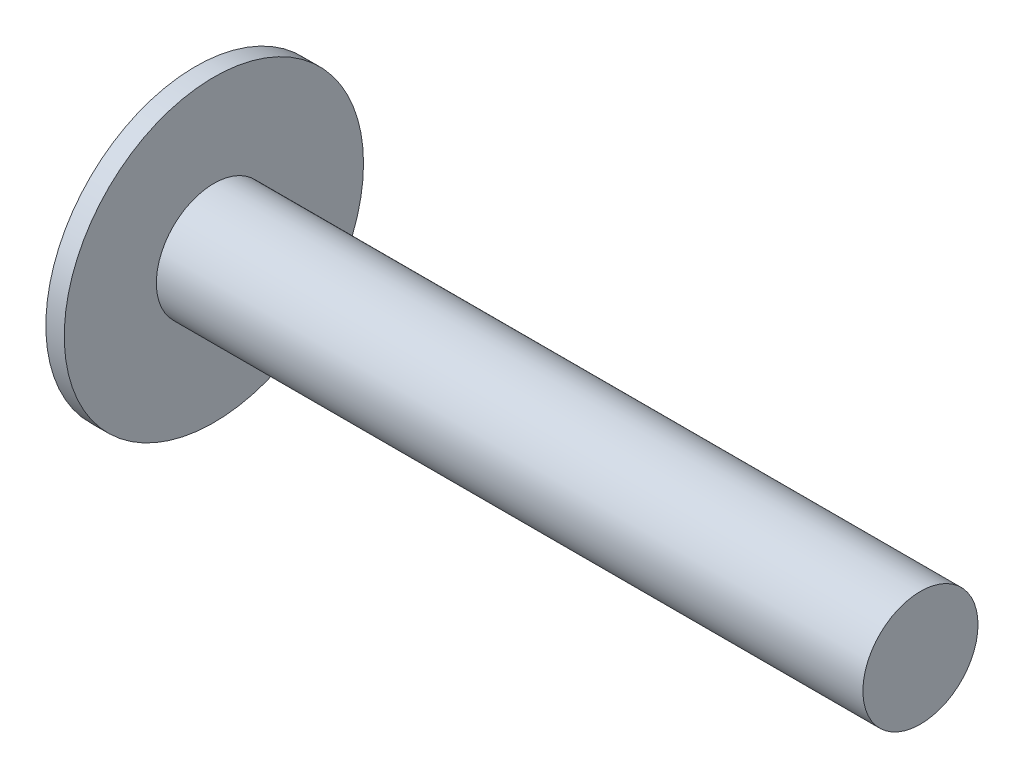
ISO-10303-21;
HEADER;
FILE_DESCRIPTION(('STEP AP214'),'2;1');
FILE_NAME('part.step','',(''),(''),'','','');
FILE_SCHEMA(('AUTOMOTIVE_DESIGN { 1 0 10303 214 1 1 1 1 }'));
ENDSEC;
DATA;
#1=APPLICATION_CONTEXT('core data for automotive mechanical design processes');
#2=APPLICATION_PROTOCOL_DEFINITION('international standard','automotive_design',2000,#1);
#3=PRODUCT_CONTEXT('',#1,'mechanical');
#4=PRODUCT('Part','Part','',(#3));
#5=PRODUCT_RELATED_PRODUCT_CATEGORY('part','',(#4));
#6=PRODUCT_DEFINITION_FORMATION('','',#4);
#7=PRODUCT_DEFINITION_CONTEXT('part definition',#1,'design');
#8=PRODUCT_DEFINITION('design','',#6,#7);
#9=PRODUCT_DEFINITION_SHAPE('','',#8);
#10=(LENGTH_UNIT() NAMED_UNIT(*) SI_UNIT(.MILLI.,.METRE.));
#11=(NAMED_UNIT(*) PLANE_ANGLE_UNIT() SI_UNIT($,.RADIAN.));
#12=(NAMED_UNIT(*) SI_UNIT($,.STERADIAN.) SOLID_ANGLE_UNIT());
#13=UNCERTAINTY_MEASURE_WITH_UNIT(LENGTH_MEASURE(1.E-05),#10,'distance_accuracy_value','');
#14=(GEOMETRIC_REPRESENTATION_CONTEXT(3) GLOBAL_UNCERTAINTY_ASSIGNED_CONTEXT((#13)) GLOBAL_UNIT_ASSIGNED_CONTEXT((#10,
#11,#12)) REPRESENTATION_CONTEXT('',''));
#15=CARTESIAN_POINT('',(0.,0.,0.));
#16=DIRECTION('',(0.,0.,1.));
#17=DIRECTION('',(1.,0.,0.));
#18=AXIS2_PLACEMENT_3D('',#15,#16,#17);
#19=CARTESIAN_POINT('',(0.,0.,0.));
#20=DIRECTION('',(-1.,0.,0.));
#21=DIRECTION('',(0.,0.,1.));
#22=AXIS2_PLACEMENT_3D('',#19,#20,#21);
#23=PLANE('',#22);
#24=CARTESIAN_POINT('',(0.,0.,-1.5875));
#25=DIRECTION('',(1.,0.,0.));
#26=DIRECTION('',(0.,0.,-1.));
#27=AXIS2_PLACEMENT_3D('',#24,#25,#26);
#28=CIRCLE('',#27,1.5875);
#29=CARTESIAN_POINT('',(0.,0.,-3.175));
#30=VERTEX_POINT('',#29);
#31=EDGE_CURVE('E125',#30,#30,#28,.T.);
#32=ORIENTED_EDGE('',*,*,#31,.T.);
#33=EDGE_LOOP('',(#32));
#34=FACE_BOUND('',#33,.T.);
#35=ADVANCED_FACE('F39',(#34),#23,.F.);
#36=CARTESIAN_POINT('',(-19.9980085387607,0.,2.54));
#37=DIRECTION('',(1.,0.,0.));
#38=DIRECTION('',(0.,0.,-1.));
#39=AXIS2_PLACEMENT_3D('',#36,#37,#38);
#40=PLANE('',#39);
#41=DIRECTION('',(0.,0.,1.));
#42=VECTOR('',#41,1.);
#43=CARTESIAN_POINT('',(-19.9980085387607,-0.378183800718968,0.));
#44=LINE('',#43,#42);
#45=CARTESIAN_POINT('',(-19.9980085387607,-0.378183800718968,-3.37400870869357));
#46=VERTEX_POINT('',#45);
#47=CARTESIAN_POINT('',(-19.9980085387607,-0.378183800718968,0.));
#48=VERTEX_POINT('',#47);
#49=EDGE_CURVE('E89',#46,#48,#44,.T.);
#50=ORIENTED_EDGE('',*,*,#49,.F.);
#51=DIRECTION('',(0.,-1.,0.));
#52=VECTOR('',#51,1.);
#53=CARTESIAN_POINT('',(-19.9980085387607,-0.378183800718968,-3.37400870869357));
#54=LINE('',#53,#52);
#55=CARTESIAN_POINT('',(-19.9980085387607,0.35268826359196,-3.37400870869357));
#56=VERTEX_POINT('',#55);
#57=EDGE_CURVE('E54',#56,#46,#54,.T.);
#58=ORIENTED_EDGE('',*,*,#57,.F.);
#59=DIRECTION('',(0.,0.,-1.));
#60=VECTOR('',#59,1.);
#61=CARTESIAN_POINT('',(-19.9980085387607,0.35268826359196,-3.37400870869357));
#62=LINE('',#61,#60);
#63=CARTESIAN_POINT('',(-19.9980085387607,0.35268826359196,0.));
#64=VERTEX_POINT('',#63);
#65=EDGE_CURVE('E109',#64,#56,#62,.T.);
#66=ORIENTED_EDGE('',*,*,#65,.F.);
#67=DIRECTION('',(0.,1.,0.));
#68=VECTOR('',#67,1.);
#69=CARTESIAN_POINT('',(-19.9980085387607,0.35268826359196,0.));
#70=LINE('',#69,#68);
#71=EDGE_CURVE('E118',#48,#64,#70,.T.);
#72=ORIENTED_EDGE('',*,*,#71,.F.);
#73=EDGE_LOOP('',(#50,#58,#66,#72));
#74=FACE_BOUND('',#73,.T.);
#75=CARTESIAN_POINT('',(-19.9980085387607,0.,-1.5875));
#76=DIRECTION('',(1.,0.,0.));
#77=DIRECTION('',(0.,0.,-1.));
#78=AXIS2_PLACEMENT_3D('',#75,#76,#77);
#79=CIRCLE('',#78,4.1275);
#80=CARTESIAN_POINT('',(-19.9980085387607,0.,-5.715));
#81=VERTEX_POINT('',#80);
#82=EDGE_CURVE('E11',#81,#81,#79,.T.);
#83=ORIENTED_EDGE('',*,*,#82,.F.);
#84=EDGE_LOOP('',(#83));
#85=FACE_BOUND('',#84,.T.);
#86=ADVANCED_FACE('F145',(#74,#85),#40,.F.);
#87=CARTESIAN_POINT('',(0.,0.,-1.5875));
#88=DIRECTION('',(1.,0.,0.));
#89=DIRECTION('',(0.,0.,-1.));
#90=AXIS2_PLACEMENT_3D('',#87,#88,#89);
#91=CYLINDRICAL_SURFACE('',#90,4.1275);
#92=CARTESIAN_POINT('',(-19.4900085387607,0.,-1.5875));
#93=DIRECTION('',(1.,0.,0.));
#94=DIRECTION('',(0.,0.,-1.));
#95=AXIS2_PLACEMENT_3D('',#92,#93,#94);
#96=CIRCLE('',#95,4.1275);
#97=CARTESIAN_POINT('',(-19.4900085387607,0.,-5.715));
#98=VERTEX_POINT('',#97);
#99=EDGE_CURVE('E47',#98,#98,#96,.T.);
#100=ORIENTED_EDGE('',*,*,#99,.F.);
#101=EDGE_LOOP('',(#100));
#102=FACE_BOUND('',#101,.T.);
#103=ORIENTED_EDGE('',*,*,#82,.T.);
#104=EDGE_LOOP('',(#103));
#105=FACE_BOUND('',#104,.T.);
#106=ADVANCED_FACE('F142',(#102,#105),#91,.T.);
#107=CARTESIAN_POINT('',(-19.4900085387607,0.,0.));
#108=DIRECTION('',(-1.,0.,0.));
#109=DIRECTION('',(0.,0.,1.));
#110=AXIS2_PLACEMENT_3D('',#107,#108,#109);
#111=PLANE('',#110);
#112=CARTESIAN_POINT('',(-19.4900085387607,0.,-1.5875));
#113=DIRECTION('',(1.,0.,0.));
#114=DIRECTION('',(0.,0.,-1.));
#115=AXIS2_PLACEMENT_3D('',#112,#113,#114);
#116=CIRCLE('',#115,1.5875);
#117=CARTESIAN_POINT('',(-19.4900085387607,0.,-3.175));
#118=VERTEX_POINT('',#117);
#119=EDGE_CURVE('E133',#118,#118,#116,.T.);
#120=ORIENTED_EDGE('',*,*,#119,.F.);
#121=EDGE_LOOP('',(#120));
#122=FACE_BOUND('',#121,.T.);
#123=ORIENTED_EDGE('',*,*,#99,.T.);
#124=EDGE_LOOP('',(#123));
#125=FACE_BOUND('',#124,.T.);
#126=ADVANCED_FACE('F140',(#122,#125),#111,.F.);
#127=CARTESIAN_POINT('',(0.,0.,-1.5875));
#128=DIRECTION('',(1.,0.,0.));
#129=DIRECTION('',(0.,0.,-1.));
#130=AXIS2_PLACEMENT_3D('',#127,#128,#129);
#131=CYLINDRICAL_SURFACE('',#130,1.5875);
#132=ORIENTED_EDGE('',*,*,#31,.F.);
#133=EDGE_LOOP('',(#132));
#134=FACE_BOUND('',#133,.T.);
#135=ORIENTED_EDGE('',*,*,#119,.T.);
#136=EDGE_LOOP('',(#135));
#137=FACE_BOUND('',#136,.T.);
#138=ADVANCED_FACE('F158',(#134,#137),#131,.T.);
#139=CARTESIAN_POINT('',(-19.7440085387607,-0.378183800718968,-3.37400870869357));
#140=DIRECTION('',(0.,0.,-1.));
#141=DIRECTION('',(-1.,0.,0.));
#142=AXIS2_PLACEMENT_3D('',#139,#140,#141);
#143=PLANE('',#142);
#144=ORIENTED_EDGE('',*,*,#57,.T.);
#145=DIRECTION('',(-1.,0.,0.));
#146=VECTOR('',#145,1.);
#147=CARTESIAN_POINT('',(-19.7440085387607,-0.378183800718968,-3.37400870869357));
#148=LINE('',#147,#146);
#149=CARTESIAN_POINT('',(-19.7440085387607,-0.378183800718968,-3.37400870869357));
#150=VERTEX_POINT('',#149);
#151=EDGE_CURVE('E77',#150,#46,#148,.T.);
#152=ORIENTED_EDGE('',*,*,#151,.F.);
#153=DIRECTION('',(0.,-1.,0.));
#154=VECTOR('',#153,1.);
#155=CARTESIAN_POINT('',(-19.7440085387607,-0.378183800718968,-3.37400870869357));
#156=LINE('',#155,#154);
#157=CARTESIAN_POINT('',(-19.7440085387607,0.35268826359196,-3.37400870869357));
#158=VERTEX_POINT('',#157);
#159=EDGE_CURVE('E105',#158,#150,#156,.T.);
#160=ORIENTED_EDGE('',*,*,#159,.F.);
#161=DIRECTION('',(-1.,0.,0.));
#162=VECTOR('',#161,1.);
#163=CARTESIAN_POINT('',(-19.7440085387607,0.35268826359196,-3.37400870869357));
#164=LINE('',#163,#162);
#165=EDGE_CURVE('E62',#158,#56,#164,.T.);
#166=ORIENTED_EDGE('',*,*,#165,.T.);
#167=EDGE_LOOP('',(#144,#152,#160,#166));
#168=FACE_BOUND('',#167,.T.);
#169=ADVANCED_FACE('F162',(#168),#143,.F.);
#170=CARTESIAN_POINT('',(-19.7440085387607,0.35268826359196,-3.37400870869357));
#171=DIRECTION('',(0.,1.,0.));
#172=DIRECTION('',(0.,0.,1.));
#173=AXIS2_PLACEMENT_3D('',#170,#171,#172);
#174=PLANE('',#173);
#175=ORIENTED_EDGE('',*,*,#65,.T.);
#176=ORIENTED_EDGE('',*,*,#165,.F.);
#177=DIRECTION('',(0.,0.,-1.));
#178=VECTOR('',#177,1.);
#179=CARTESIAN_POINT('',(-19.7440085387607,0.35268826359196,-3.37400870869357));
#180=LINE('',#179,#178);
#181=CARTESIAN_POINT('',(-19.7440085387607,0.35268826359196,0.));
#182=VERTEX_POINT('',#181);
#183=EDGE_CURVE('E102',#182,#158,#180,.T.);
#184=ORIENTED_EDGE('',*,*,#183,.F.);
#185=DIRECTION('',(-1.,0.,0.));
#186=VECTOR('',#185,1.);
#187=CARTESIAN_POINT('',(-19.7440085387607,0.35268826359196,0.));
#188=LINE('',#187,#186);
#189=EDGE_CURVE('E94',#182,#64,#188,.T.);
#190=ORIENTED_EDGE('',*,*,#189,.T.);
#191=EDGE_LOOP('',(#175,#176,#184,#190));
#192=FACE_BOUND('',#191,.T.);
#193=ADVANCED_FACE('F166',(#192),#174,.F.);
#194=CARTESIAN_POINT('',(-19.7440085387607,0.35268826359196,0.));
#195=DIRECTION('',(0.,0.,1.));
#196=DIRECTION('',(1.,0.,0.));
#197=AXIS2_PLACEMENT_3D('',#194,#195,#196);
#198=PLANE('',#197);
#199=ORIENTED_EDGE('',*,*,#71,.T.);
#200=ORIENTED_EDGE('',*,*,#189,.F.);
#201=DIRECTION('',(0.,1.,0.));
#202=VECTOR('',#201,1.);
#203=CARTESIAN_POINT('',(-19.7440085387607,0.35268826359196,0.));
#204=LINE('',#203,#202);
#205=CARTESIAN_POINT('',(-19.7440085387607,-0.378183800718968,0.));
#206=VERTEX_POINT('',#205);
#207=EDGE_CURVE('E97',#206,#182,#204,.T.);
#208=ORIENTED_EDGE('',*,*,#207,.F.);
#209=DIRECTION('',(-1.,0.,0.));
#210=VECTOR('',#209,1.);
#211=CARTESIAN_POINT('',(-19.7440085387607,-0.378183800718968,0.));
#212=LINE('',#211,#210);
#213=EDGE_CURVE('E82',#206,#48,#212,.T.);
#214=ORIENTED_EDGE('',*,*,#213,.T.);
#215=EDGE_LOOP('',(#199,#200,#208,#214));
#216=FACE_BOUND('',#215,.T.);
#217=ADVANCED_FACE('F98',(#216),#198,.F.);
#218=CARTESIAN_POINT('',(-19.7440085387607,-0.378183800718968,0.));
#219=DIRECTION('',(0.,-1.,0.));
#220=DIRECTION('',(0.,0.,-1.));
#221=AXIS2_PLACEMENT_3D('',#218,#219,#220);
#222=PLANE('',#221);
#223=ORIENTED_EDGE('',*,*,#49,.T.);
#224=ORIENTED_EDGE('',*,*,#213,.F.);
#225=DIRECTION('',(0.,0.,1.));
#226=VECTOR('',#225,1.);
#227=CARTESIAN_POINT('',(-19.7440085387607,-0.378183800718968,0.));
#228=LINE('',#227,#226);
#229=EDGE_CURVE('E86',#150,#206,#228,.T.);
#230=ORIENTED_EDGE('',*,*,#229,.F.);
#231=ORIENTED_EDGE('',*,*,#151,.T.);
#232=EDGE_LOOP('',(#223,#224,#230,#231));
#233=FACE_BOUND('',#232,.T.);
#234=ADVANCED_FACE('F84',(#233),#222,.F.);
#235=CARTESIAN_POINT('',(-19.7440085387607,0.,0.));
#236=DIRECTION('',(1.,0.,0.));
#237=DIRECTION('',(0.,0.,-1.));
#238=AXIS2_PLACEMENT_3D('',#235,#236,#237);
#239=PLANE('',#238);
#240=ORIENTED_EDGE('',*,*,#159,.T.);
#241=ORIENTED_EDGE('',*,*,#229,.T.);
#242=ORIENTED_EDGE('',*,*,#207,.T.);
#243=ORIENTED_EDGE('',*,*,#183,.T.);
#244=EDGE_LOOP('',(#240,#241,#242,#243));
#245=FACE_BOUND('',#244,.T.);
#246=ADVANCED_FACE('F104',(#245),#239,.F.);
#247=CLOSED_SHELL('',(#35,#86,#106,#126,#138,#169,#193,#217,#234,#246));
#248=MANIFOLD_SOLID_BREP('B2',#247);
#249=ADVANCED_BREP_SHAPE_REPRESENTATION('',(#18,#248),#14);
#250=SHAPE_DEFINITION_REPRESENTATION(#9,#249);
ENDSEC;
END-ISO-10303-21;
